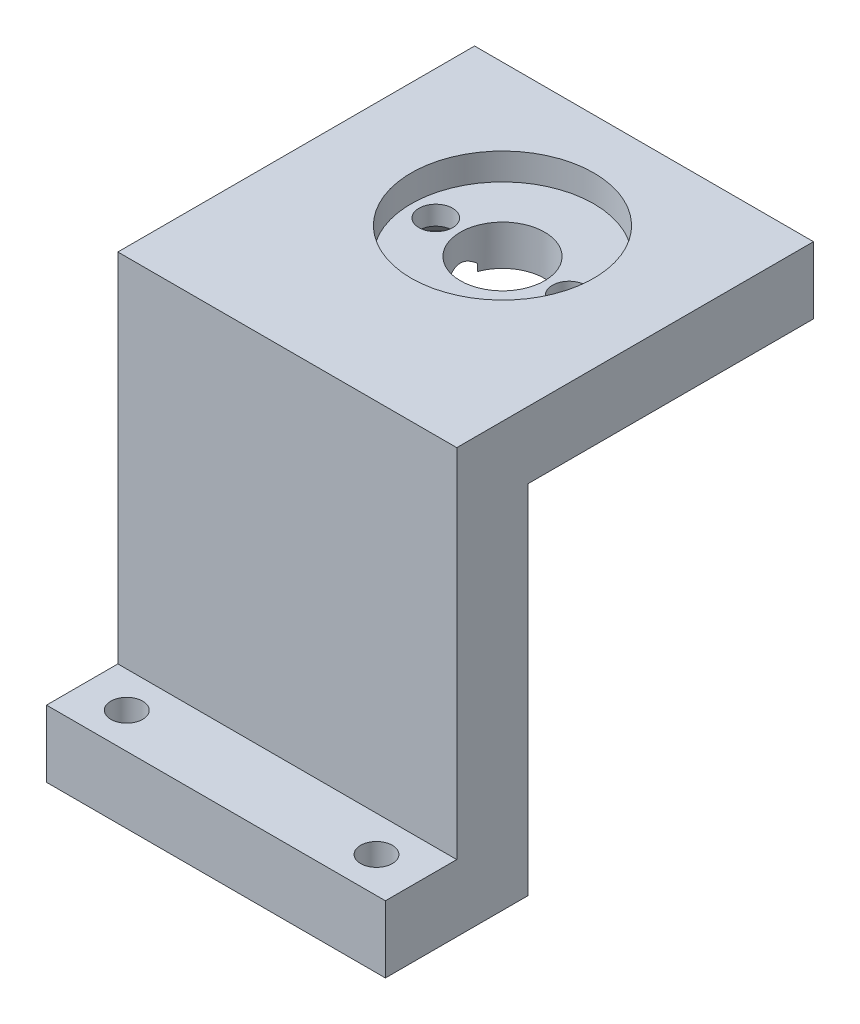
from build123d import *

# Parameters (mm, degrees)
EXTRUDE1_DEPTH                                 = 12.065
EXTRUDE1_DEPTH_BACK                            = 12.065
F_4_40_TAPPED_HOLE1_D                          = 2.2606
F_4_40_TAPPED_HOLE1_DEPTH                      = 8.8646
F_4_40_TAPPED_HOLE1_TIP                        = 0.679152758
EXTRUDE2_REACH                                 = 46.546
SKETCH4_R                                      = 3
CSK_FOR_M2_FLAT_HEAD_MACHINE_SCREW1_AT_2_COUNT = 2
CSK_FOR_M2_FLAT_HEAD_MACHINE_SCREW1_AT_2_PITCH = 9.5
F_3_32_0_09375_DIAMETER_HOLE1_D                = 2.38125
F_3_32_0_09375_DIAMETER_HOLE1_DEPTH            = 3.9878
SKETCH10_R                                     = 6.5
EXTRUDE3_DEPTH                                 = 1.905


with BuildPart() as part:
    # Sketch1 → Extrude1 (new, two sides: drawn at the far end of the back side and taken through both)
    with BuildSketch(Plane(origin=(0, 0, 0), x_dir=(0, 0, -1), z_dir=(1, 0, 0)).offset(-EXTRUDE1_DEPTH_BACK)):
        Polygon((10.16, 0), (0, 0), (0, 4.7625), (5.08, 4.7625), (5.08, 30.1625), (30.48, 30.1625), (30.48, 25.4), (10.16, 25.4), align=None)
    extrude(amount=EXTRUDE1_DEPTH + EXTRUDE1_DEPTH_BACK)

    # 4-40 Tapped Hole1
    with Locations(Plane(origin=(0, 4.7625, 0), x_dir=(-1, 0, 0), z_dir=(0, 1, 0))):
        with Locations((8.89, -2.54), (-8.89, -2.54)):
            Hole(F_4_40_TAPPED_HOLE1_D / 2, depth=F_4_40_TAPPED_HOLE1_DEPTH)
            with Locations((0, 0, -(F_4_40_TAPPED_HOLE1_DEPTH + F_4_40_TAPPED_HOLE1_TIP / 2))):  # 118° drill point
                Cone(0, F_4_40_TAPPED_HOLE1_D / 2, F_4_40_TAPPED_HOLE1_TIP, mode=Mode.SUBTRACT)

    # Sketch4 → Extrude2 (cut, up to next)
    with BuildSketch(Plane(origin=(0, 30.1625, 0), x_dir=(1, 0, 0), z_dir=(0, 1, 0)), mode=Mode.PRIVATE) as extrude2_sk1:
        with Locations(Location((0, 20.402073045, 0), (0, 0, 270))):
            Circle(SKETCH4_R)
    extrude2_tool1 = extrude(extrude2_sk1.sketch, amount=-EXTRUDE2_REACH, mode=Mode.PRIVATE) & part.part
    add(extrude2_tool1.solids().sort_by_distance((0, 30.1625, -20.402073))[0], mode=Mode.SUBTRACT)

    # Sketch6 → CSK for M2 Flat Head Machine Screw1 (revolve, cut)
    with BuildSketch(Plane(origin=(4.75, 25.4, -20.402073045), x_dir=(0, 0, -1), z_dir=(1, 0, 0))):
        Polygon((0, 0), (0, 4.7625), (1.2, 4.7625), (1.2, 1.50038), (2.2, 0.50038), (2.2, 0), align=None)
    csk_for_m2_flat_head_machine_screw1 = revolve(axis=Axis((4.75, 19.05, -20.402073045), (0, 1, 0)), mode=Mode.SUBTRACT)

    # CSK for M2 Flat Head Machine Screw1 at 2: CSK for M2 Flat Head Machine Screw1 ×2
    with Locations(*[(-i * CSK_FOR_M2_FLAT_HEAD_MACHINE_SCREW1_AT_2_PITCH, 0, 0) for i in range(1, CSK_FOR_M2_FLAT_HEAD_MACHINE_SCREW1_AT_2_COUNT)]):
        add(csk_for_m2_flat_head_machine_screw1, mode=Mode.SUBTRACT)

    # 3_32 _0.09375_ Diameter Hole1
    with Locations(Plane.XZ):
        with Locations((5.715, -8.128), (-5.715, -8.128)):
            Hole(F_3_32_0_09375_DIAMETER_HOLE1_D / 2, depth=F_3_32_0_09375_DIAMETER_HOLE1_DEPTH)

    # Sketch10 → Extrude3 (cut)
    with BuildSketch(Plane(origin=(0, 30.1625, 0), x_dir=(1, 0, 0), z_dir=(0, 1, 0))):
        with Locations(Location((0, 20.402073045, 0), (0, 0, 270))):
            Circle(SKETCH10_R)
    extrude(amount=-EXTRUDE3_DEPTH, mode=Mode.SUBTRACT)


solid = part.part
